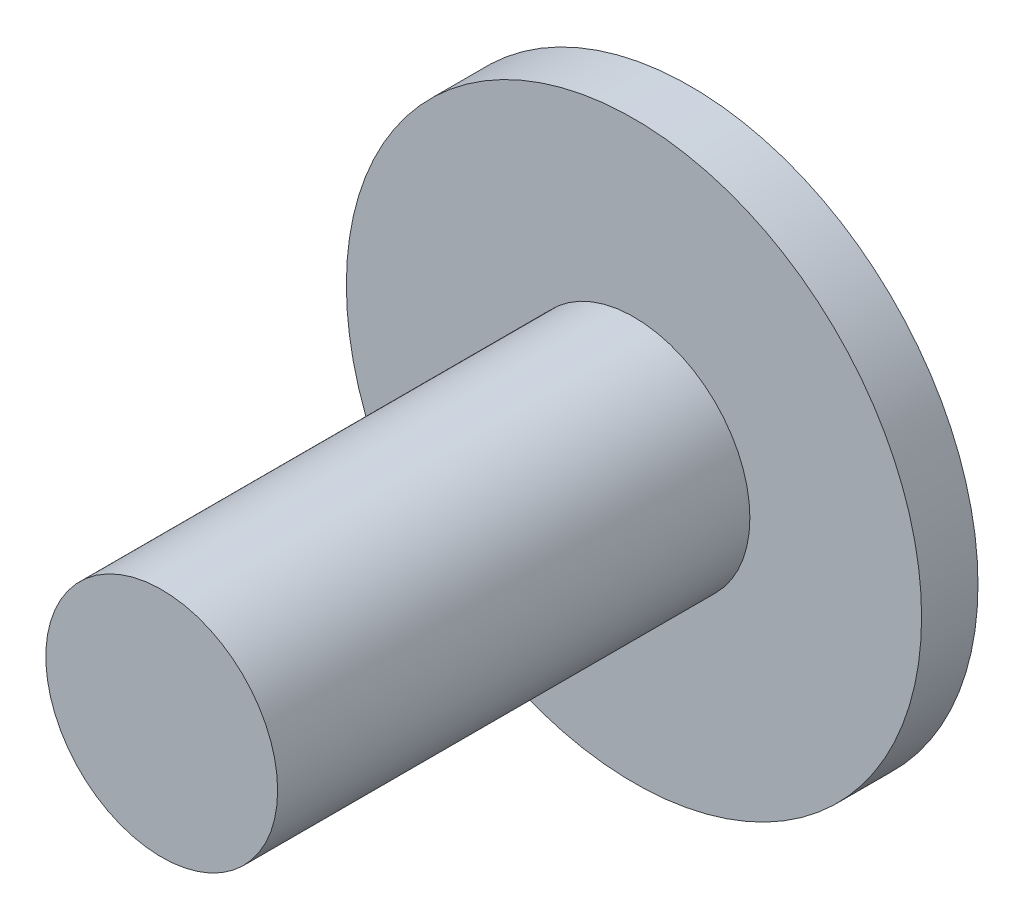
ISO-10303-21;
HEADER;
FILE_DESCRIPTION(('STEP AP214'),'2;1');
FILE_NAME('part.step','',(''),(''),'','','');
FILE_SCHEMA(('AUTOMOTIVE_DESIGN { 1 0 10303 214 1 1 1 1 }'));
ENDSEC;
DATA;
#1=APPLICATION_CONTEXT('core data for automotive mechanical design processes');
#2=APPLICATION_PROTOCOL_DEFINITION('international standard','automotive_design',2000,#1);
#3=PRODUCT_CONTEXT('',#1,'mechanical');
#4=PRODUCT('Part','Part','',(#3));
#5=PRODUCT_RELATED_PRODUCT_CATEGORY('part','',(#4));
#6=PRODUCT_DEFINITION_FORMATION('','',#4);
#7=PRODUCT_DEFINITION_CONTEXT('part definition',#1,'design');
#8=PRODUCT_DEFINITION('design','',#6,#7);
#9=PRODUCT_DEFINITION_SHAPE('','',#8);
#10=(LENGTH_UNIT() NAMED_UNIT(*) SI_UNIT(.MILLI.,.METRE.));
#11=(NAMED_UNIT(*) PLANE_ANGLE_UNIT() SI_UNIT($,.RADIAN.));
#12=(NAMED_UNIT(*) SI_UNIT($,.STERADIAN.) SOLID_ANGLE_UNIT());
#13=UNCERTAINTY_MEASURE_WITH_UNIT(LENGTH_MEASURE(1.E-05),#10,'distance_accuracy_value','');
#14=(GEOMETRIC_REPRESENTATION_CONTEXT(3) GLOBAL_UNCERTAINTY_ASSIGNED_CONTEXT((#13)) GLOBAL_UNIT_ASSIGNED_CONTEXT((#10,
#11,#12)) REPRESENTATION_CONTEXT('',''));
#15=CARTESIAN_POINT('',(0.,0.,0.));
#16=DIRECTION('',(0.,0.,1.));
#17=DIRECTION('',(1.,0.,0.));
#18=AXIS2_PLACEMENT_3D('',#15,#16,#17);
#19=CARTESIAN_POINT('',(0.,0.,4.826));
#20=DIRECTION('',(0.,0.,-1.));
#21=DIRECTION('',(-1.,0.,0.));
#22=AXIS2_PLACEMENT_3D('',#19,#20,#21);
#23=CYLINDRICAL_SURFACE('',#22,24.6126);
#24=CARTESIAN_POINT('',(0.,0.,4.826));
#25=DIRECTION('',(0.,0.,1.));
#26=DIRECTION('',(1.,0.,0.));
#27=AXIS2_PLACEMENT_3D('',#24,#25,#26);
#28=CIRCLE('',#27,24.6126);
#29=CARTESIAN_POINT('',(24.6126,0.,4.826));
#30=VERTEX_POINT('',#29);
#31=EDGE_CURVE('E10',#30,#30,#28,.T.);
#32=ORIENTED_EDGE('',*,*,#31,.F.);
#33=EDGE_LOOP('',(#32));
#34=FACE_BOUND('',#33,.T.);
#35=CARTESIAN_POINT('',(0.,0.,0.));
#36=DIRECTION('',(0.,0.,1.));
#37=DIRECTION('',(1.,0.,0.));
#38=AXIS2_PLACEMENT_3D('',#35,#36,#37);
#39=CIRCLE('',#38,24.6126);
#40=CARTESIAN_POINT('',(24.6126,0.,0.));
#41=VERTEX_POINT('',#40);
#42=EDGE_CURVE('E44',#41,#41,#39,.T.);
#43=ORIENTED_EDGE('',*,*,#42,.T.);
#44=EDGE_LOOP('',(#43));
#45=FACE_BOUND('',#44,.T.);
#46=ADVANCED_FACE('F41',(#34,#45),#23,.T.);
#47=CARTESIAN_POINT('',(0.,0.,4.826));
#48=DIRECTION('',(0.,0.,1.));
#49=DIRECTION('',(1.,0.,0.));
#50=AXIS2_PLACEMENT_3D('',#47,#48,#49);
#51=PLANE('',#50);
#52=CARTESIAN_POINT('',(0.,0.,4.826));
#53=DIRECTION('',(0.,0.,1.));
#54=DIRECTION('',(1.,0.,0.));
#55=AXIS2_PLACEMENT_3D('',#52,#53,#54);
#56=CIRCLE('',#55,9.9187);
#57=CARTESIAN_POINT('',(9.9187,0.,4.826));
#58=VERTEX_POINT('',#57);
#59=EDGE_CURVE('E51',#58,#58,#56,.F.);
#60=ORIENTED_EDGE('',*,*,#59,.T.);
#61=EDGE_LOOP('',(#60));
#62=FACE_BOUND('',#61,.T.);
#63=ORIENTED_EDGE('',*,*,#31,.T.);
#64=EDGE_LOOP('',(#63));
#65=FACE_BOUND('',#64,.T.);
#66=ADVANCED_FACE('F77',(#62,#65),#51,.T.);
#67=CARTESIAN_POINT('',(0.,0.,0.));
#68=DIRECTION('',(0.,0.,1.));
#69=DIRECTION('',(1.,0.,0.));
#70=AXIS2_PLACEMENT_3D('',#67,#68,#69);
#71=PLANE('',#70);
#72=CARTESIAN_POINT('',(0.,0.,0.));
#73=DIRECTION('',(0.,0.,1.));
#74=DIRECTION('',(1.,0.,0.));
#75=AXIS2_PLACEMENT_3D('',#72,#73,#74);
#76=CIRCLE('',#75,8.7122);
#77=CARTESIAN_POINT('',(8.7122,0.,0.));
#78=VERTEX_POINT('',#77);
#79=EDGE_CURVE('E59',#78,#78,#76,.T.);
#80=ORIENTED_EDGE('',*,*,#79,.T.);
#81=EDGE_LOOP('',(#80));
#82=FACE_BOUND('',#81,.T.);
#83=ORIENTED_EDGE('',*,*,#42,.F.);
#84=EDGE_LOOP('',(#83));
#85=FACE_BOUND('',#84,.T.);
#86=ADVANCED_FACE('F82',(#82,#85),#71,.F.);
#87=CARTESIAN_POINT('',(0.,0.,45.2374));
#88=DIRECTION('',(0.,0.,-1.));
#89=DIRECTION('',(-1.,0.,0.));
#90=AXIS2_PLACEMENT_3D('',#87,#88,#89);
#91=CYLINDRICAL_SURFACE('',#90,9.9187);
#92=ORIENTED_EDGE('',*,*,#59,.F.);
#93=EDGE_LOOP('',(#92));
#94=FACE_BOUND('',#93,.T.);
#95=CARTESIAN_POINT('',(0.,0.,45.2374));
#96=DIRECTION('',(0.,0.,1.));
#97=DIRECTION('',(1.,0.,0.));
#98=AXIS2_PLACEMENT_3D('',#95,#96,#97);
#99=CIRCLE('',#98,9.9187);
#100=CARTESIAN_POINT('',(9.9187,0.,45.2374));
#101=VERTEX_POINT('',#100);
#102=EDGE_CURVE('E55',#101,#101,#99,.T.);
#103=ORIENTED_EDGE('',*,*,#102,.F.);
#104=EDGE_LOOP('',(#103));
#105=FACE_BOUND('',#104,.T.);
#106=ADVANCED_FACE('F89',(#94,#105),#91,.T.);
#107=CARTESIAN_POINT('',(0.,0.,45.2374));
#108=DIRECTION('',(0.,0.,1.));
#109=DIRECTION('',(1.,0.,0.));
#110=AXIS2_PLACEMENT_3D('',#107,#108,#109);
#111=PLANE('',#110);
#112=ORIENTED_EDGE('',*,*,#102,.T.);
#113=EDGE_LOOP('',(#112));
#114=FACE_BOUND('',#113,.T.);
#115=ADVANCED_FACE('F74',(#114),#111,.T.);
#116=CARTESIAN_POINT('',(0.,0.,9.525));
#117=DIRECTION('',(0.,0.,-1.));
#118=DIRECTION('',(-1.,0.,0.));
#119=AXIS2_PLACEMENT_3D('',#116,#117,#118);
#120=CYLINDRICAL_SURFACE('',#119,8.7122);
#121=CARTESIAN_POINT('',(0.,0.,9.525));
#122=DIRECTION('',(0.,0.,1.));
#123=DIRECTION('',(1.,0.,0.));
#124=AXIS2_PLACEMENT_3D('',#121,#122,#123);
#125=CIRCLE('',#124,8.7122);
#126=CARTESIAN_POINT('',(8.7122,0.,9.525));
#127=VERTEX_POINT('',#126);
#128=EDGE_CURVE('E58',#127,#127,#125,.T.);
#129=ORIENTED_EDGE('',*,*,#128,.T.);
#130=EDGE_LOOP('',(#129));
#131=FACE_BOUND('',#130,.T.);
#132=ORIENTED_EDGE('',*,*,#79,.F.);
#133=EDGE_LOOP('',(#132));
#134=FACE_BOUND('',#133,.T.);
#135=ADVANCED_FACE('F65',(#131,#134),#120,.F.);
#136=CARTESIAN_POINT('',(0.,0.,9.525));
#137=DIRECTION('',(0.,0.,1.));
#138=DIRECTION('',(1.,0.,0.));
#139=AXIS2_PLACEMENT_3D('',#136,#137,#138);
#140=PLANE('',#139);
#141=ORIENTED_EDGE('',*,*,#128,.F.);
#142=EDGE_LOOP('',(#141));
#143=FACE_BOUND('',#142,.T.);
#144=ADVANCED_FACE('F68',(#143),#140,.F.);
#145=CLOSED_SHELL('',(#46,#66,#86,#106,#115,#135,#144));
#146=MANIFOLD_SOLID_BREP('B2',#145);
#147=ADVANCED_BREP_SHAPE_REPRESENTATION('',(#18,#146),#14);
#148=SHAPE_DEFINITION_REPRESENTATION(#9,#147);
ENDSEC;
END-ISO-10303-21;
